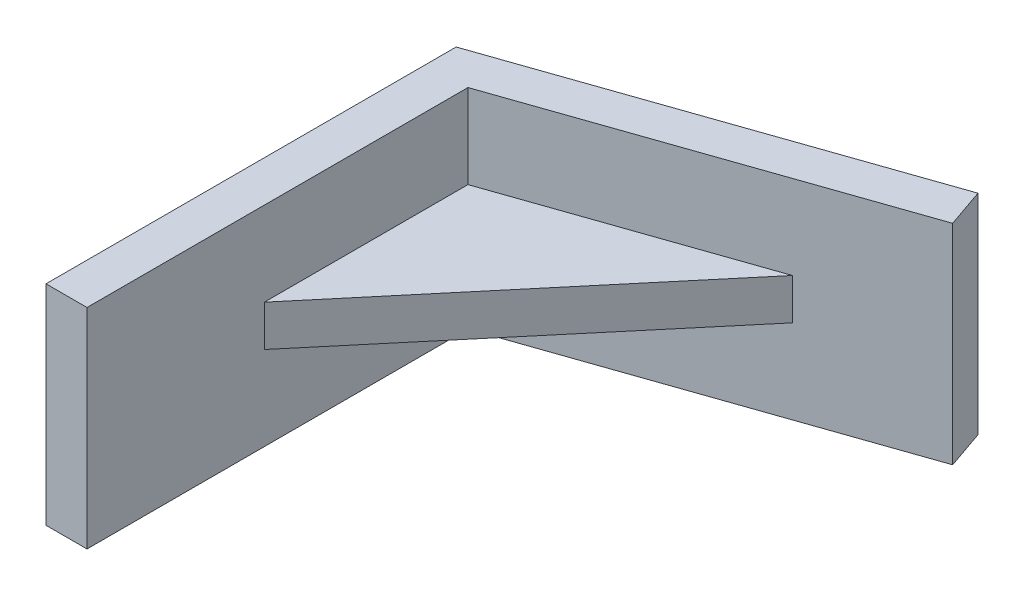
ISO-10303-21;
HEADER;
FILE_DESCRIPTION(('STEP AP214'),'2;1');
FILE_NAME('part.step','',(''),(''),'','','');
FILE_SCHEMA(('AUTOMOTIVE_DESIGN { 1 0 10303 214 1 1 1 1 }'));
ENDSEC;
DATA;
#1=APPLICATION_CONTEXT('core data for automotive mechanical design processes');
#2=APPLICATION_PROTOCOL_DEFINITION('international standard','automotive_design',2000,#1);
#3=PRODUCT_CONTEXT('',#1,'mechanical');
#4=PRODUCT('Part','Part','',(#3));
#5=PRODUCT_RELATED_PRODUCT_CATEGORY('part','',(#4));
#6=PRODUCT_DEFINITION_FORMATION('','',#4);
#7=PRODUCT_DEFINITION_CONTEXT('part definition',#1,'design');
#8=PRODUCT_DEFINITION('design','',#6,#7);
#9=PRODUCT_DEFINITION_SHAPE('','',#8);
#10=(LENGTH_UNIT() NAMED_UNIT(*) SI_UNIT(.MILLI.,.METRE.));
#11=(NAMED_UNIT(*) PLANE_ANGLE_UNIT() SI_UNIT($,.RADIAN.));
#12=(NAMED_UNIT(*) SI_UNIT($,.STERADIAN.) SOLID_ANGLE_UNIT());
#13=UNCERTAINTY_MEASURE_WITH_UNIT(LENGTH_MEASURE(1.E-05),#10,'distance_accuracy_value','');
#14=(GEOMETRIC_REPRESENTATION_CONTEXT(3) GLOBAL_UNCERTAINTY_ASSIGNED_CONTEXT((#13)) GLOBAL_UNIT_ASSIGNED_CONTEXT((#10,
#11,#12)) REPRESENTATION_CONTEXT('',''));
#15=CARTESIAN_POINT('',(0.,0.,0.));
#16=DIRECTION('',(0.,0.,1.));
#17=DIRECTION('',(1.,0.,0.));
#18=AXIS2_PLACEMENT_3D('',#15,#16,#17);
#19=CARTESIAN_POINT('',(-5.00000000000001,25.5,-91.1175916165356));
#20=DIRECTION('',(0.327543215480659,0.,0.944836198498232));
#21=DIRECTION('',(0.944836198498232,0.,-0.327543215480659));
#22=AXIS2_PLACEMENT_3D('',#19,#20,#21);
#23=PLANE('',#22);
#24=DIRECTION('',(-0.944836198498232,0.,0.327543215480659));
#25=VECTOR('',#24,1.);
#26=CARTESIAN_POINT('',(-5.00000000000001,-25.5,-91.1175916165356));
#27=LINE('',#26,#25);
#28=CARTESIAN_POINT('',(89.4836198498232,-25.5,-123.871913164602));
#29=VERTEX_POINT('',#28);
#30=CARTESIAN_POINT('',(-5.00000000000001,-25.5,-91.1175916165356));
#31=VERTEX_POINT('',#30);
#32=EDGE_CURVE('E129',#29,#31,#27,.T.);
#33=ORIENTED_EDGE('',*,*,#32,.T.);
#34=DIRECTION('',(0.,-1.,0.));
#35=VECTOR('',#34,1.);
#36=CARTESIAN_POINT('',(-5.00000000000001,25.5,-91.1175916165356));
#37=LINE('',#36,#35);
#38=CARTESIAN_POINT('',(-5.00000000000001,25.5,-91.1175916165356));
#39=VERTEX_POINT('',#38);
#40=EDGE_CURVE('E118',#39,#31,#37,.T.);
#41=ORIENTED_EDGE('',*,*,#40,.F.);
#42=DIRECTION('',(-0.944836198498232,0.,0.327543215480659));
#43=VECTOR('',#42,1.);
#44=CARTESIAN_POINT('',(-5.00000000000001,25.5,-91.1175916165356));
#45=LINE('',#44,#43);
#46=CARTESIAN_POINT('',(89.4836198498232,25.5,-123.871913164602));
#47=VERTEX_POINT('',#46);
#48=EDGE_CURVE('E130',#47,#39,#45,.T.);
#49=ORIENTED_EDGE('',*,*,#48,.F.);
#50=DIRECTION('',(0.,-1.,0.));
#51=VECTOR('',#50,1.);
#52=CARTESIAN_POINT('',(89.4836198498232,25.5,-123.871913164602));
#53=LINE('',#52,#51);
#54=EDGE_CURVE('E144',#47,#29,#53,.T.);
#55=ORIENTED_EDGE('',*,*,#54,.T.);
#56=EDGE_LOOP('',(#33,#41,#49,#55));
#57=FACE_BOUND('',#56,.T.);
#58=ADVANCED_FACE('F38',(#57),#23,.F.);
#59=CARTESIAN_POINT('',(-5.00000000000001,25.5,-91.1175916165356));
#60=DIRECTION('',(1.,0.,0.));
#61=DIRECTION('',(0.,0.,-1.));
#62=AXIS2_PLACEMENT_3D('',#59,#60,#61);
#63=PLANE('',#62);
#64=ORIENTED_EDGE('',*,*,#40,.T.);
#65=DIRECTION('',(0.,0.,1.));
#66=VECTOR('',#65,1.);
#67=CARTESIAN_POINT('',(-5.00000000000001,-25.5,-91.1175916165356));
#68=LINE('',#67,#66);
#69=CARTESIAN_POINT('',(-5.,-25.5,8.88240838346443));
#70=VERTEX_POINT('',#69);
#71=EDGE_CURVE('E147',#31,#70,#68,.T.);
#72=ORIENTED_EDGE('',*,*,#71,.T.);
#73=DIRECTION('',(0.,-1.,0.));
#74=VECTOR('',#73,1.);
#75=CARTESIAN_POINT('',(-5.,25.5,8.88240838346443));
#76=LINE('',#75,#74);
#77=CARTESIAN_POINT('',(-5.,25.5,8.88240838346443));
#78=VERTEX_POINT('',#77);
#79=EDGE_CURVE('E168',#78,#70,#76,.T.);
#80=ORIENTED_EDGE('',*,*,#79,.F.);
#81=DIRECTION('',(0.,0.,1.));
#82=VECTOR('',#81,1.);
#83=CARTESIAN_POINT('',(-5.00000000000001,25.5,-91.1175916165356));
#84=LINE('',#83,#82);
#85=EDGE_CURVE('E133',#39,#78,#84,.T.);
#86=ORIENTED_EDGE('',*,*,#85,.F.);
#87=EDGE_LOOP('',(#64,#72,#80,#86));
#88=FACE_BOUND('',#87,.T.);
#89=ADVANCED_FACE('F174',(#88),#63,.F.);
#90=CARTESIAN_POINT('',(-5.,25.5,8.88240838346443));
#91=DIRECTION('',(0.,0.,-1.));
#92=DIRECTION('',(-1.,0.,0.));
#93=AXIS2_PLACEMENT_3D('',#90,#91,#92);
#94=PLANE('',#93);
#95=DIRECTION('',(1.,0.,0.));
#96=VECTOR('',#95,1.);
#97=CARTESIAN_POINT('',(-5.,-25.5,8.88240838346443));
#98=LINE('',#97,#96);
#99=CARTESIAN_POINT('',(4.99999999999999,-25.5,8.88240838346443));
#100=VERTEX_POINT('',#99);
#101=EDGE_CURVE('E149',#70,#100,#98,.T.);
#102=ORIENTED_EDGE('',*,*,#101,.T.);
#103=DIRECTION('',(0.,-1.,0.));
#104=VECTOR('',#103,1.);
#105=CARTESIAN_POINT('',(4.99999999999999,25.5,8.88240838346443));
#106=LINE('',#105,#104);
#107=CARTESIAN_POINT('',(4.99999999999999,25.5,8.88240838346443));
#108=VERTEX_POINT('',#107);
#109=EDGE_CURVE('E165',#108,#100,#106,.T.);
#110=ORIENTED_EDGE('',*,*,#109,.F.);
#111=DIRECTION('',(1.,0.,0.));
#112=VECTOR('',#111,1.);
#113=CARTESIAN_POINT('',(-5.,25.5,8.88240838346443));
#114=LINE('',#113,#112);
#115=EDGE_CURVE('E136',#78,#108,#114,.T.);
#116=ORIENTED_EDGE('',*,*,#115,.F.);
#117=ORIENTED_EDGE('',*,*,#79,.T.);
#118=EDGE_LOOP('',(#102,#110,#116,#117));
#119=FACE_BOUND('',#118,.T.);
#120=ADVANCED_FACE('F197',(#119),#94,.F.);
#121=CARTESIAN_POINT('',(5.,25.5,-84.0004131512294));
#122=DIRECTION('',(-1.,0.,0.));
#123=DIRECTION('',(0.,0.,1.));
#124=AXIS2_PLACEMENT_3D('',#121,#122,#123);
#125=PLANE('',#124);
#126=DIRECTION('',(0.,1.,0.));
#127=VECTOR('',#126,1.);
#128=CARTESIAN_POINT('',(4.99999999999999,25.5,-34.3625642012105));
#129=LINE('',#128,#127);
#130=CARTESIAN_POINT('',(4.99999999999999,-5.,-34.3625642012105));
#131=VERTEX_POINT('',#130);
#132=CARTESIAN_POINT('',(4.99999999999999,5.,-34.3625642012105));
#133=VERTEX_POINT('',#132);
#134=EDGE_CURVE('E52',#131,#133,#129,.T.);
#135=ORIENTED_EDGE('',*,*,#134,.T.);
#136=DIRECTION('',(0.,0.,-1.));
#137=VECTOR('',#136,1.);
#138=CARTESIAN_POINT('',(5.,5.,-84.0004131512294));
#139=LINE('',#138,#137);
#140=CARTESIAN_POINT('',(5.,5.,-84.0004131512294));
#141=VERTEX_POINT('',#140);
#142=EDGE_CURVE('E126',#133,#141,#139,.T.);
#143=ORIENTED_EDGE('',*,*,#142,.T.);
#144=DIRECTION('',(0.,-1.,0.));
#145=VECTOR('',#144,1.);
#146=CARTESIAN_POINT('',(5.,25.5,-84.0004131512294));
#147=LINE('',#146,#145);
#148=CARTESIAN_POINT('',(5.,25.5,-84.0004131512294));
#149=VERTEX_POINT('',#148);
#150=EDGE_CURVE('E163',#149,#141,#147,.T.);
#151=ORIENTED_EDGE('',*,*,#150,.F.);
#152=DIRECTION('',(0.,0.,-1.));
#153=VECTOR('',#152,1.);
#154=CARTESIAN_POINT('',(5.,25.5,-84.0004131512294));
#155=LINE('',#154,#153);
#156=EDGE_CURVE('E138',#108,#149,#155,.T.);
#157=ORIENTED_EDGE('',*,*,#156,.F.);
#158=ORIENTED_EDGE('',*,*,#109,.T.);
#159=DIRECTION('',(0.,0.,-1.));
#160=VECTOR('',#159,1.);
#161=CARTESIAN_POINT('',(5.,-25.5,-84.0004131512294));
#162=LINE('',#161,#160);
#163=CARTESIAN_POINT('',(5.,-25.5,-84.0004131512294));
#164=VERTEX_POINT('',#163);
#165=EDGE_CURVE('E151',#100,#164,#162,.T.);
#166=ORIENTED_EDGE('',*,*,#165,.T.);
#167=CARTESIAN_POINT('',(5.,-5.,-84.0004131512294));
#168=VERTEX_POINT('',#167);
#169=EDGE_CURVE('E162',#168,#164,#147,.T.);
#170=ORIENTED_EDGE('',*,*,#169,.F.);
#171=DIRECTION('',(0.,0.,-1.));
#172=VECTOR('',#171,1.);
#173=CARTESIAN_POINT('',(5.,-5.,-84.0004131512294));
#174=LINE('',#173,#172);
#175=EDGE_CURVE('E57',#131,#168,#174,.T.);
#176=ORIENTED_EDGE('',*,*,#175,.F.);
#177=EDGE_LOOP('',(#135,#143,#151,#157,#158,#166,#170,#176));
#178=FACE_BOUND('',#177,.T.);
#179=ADVANCED_FACE('F191',(#178),#125,.F.);
#180=CARTESIAN_POINT('',(5.,25.5,-84.0004131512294));
#181=DIRECTION('',(-0.327543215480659,0.,-0.944836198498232));
#182=DIRECTION('',(-0.944836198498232,0.,0.327543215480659));
#183=AXIS2_PLACEMENT_3D('',#180,#181,#182);
#184=PLANE('',#183);
#185=ORIENTED_EDGE('',*,*,#150,.T.);
#186=DIRECTION('',(0.944836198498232,0.,-0.327543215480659));
#187=VECTOR('',#186,1.);
#188=CARTESIAN_POINT('',(5.,5.,-84.0004131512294));
#189=LINE('',#188,#187);
#190=CARTESIAN_POINT('',(63.7369741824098,5.,-104.36256420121));
#191=VERTEX_POINT('',#190);
#192=EDGE_CURVE('E11',#141,#191,#189,.T.);
#193=ORIENTED_EDGE('',*,*,#192,.T.);
#194=DIRECTION('',(0.,-1.,0.));
#195=VECTOR('',#194,1.);
#196=CARTESIAN_POINT('',(63.7369741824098,25.5,-104.36256420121));
#197=LINE('',#196,#195);
#198=CARTESIAN_POINT('',(63.7369741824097,-5.,-104.36256420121));
#199=VERTEX_POINT('',#198);
#200=EDGE_CURVE('E45',#191,#199,#197,.T.);
#201=ORIENTED_EDGE('',*,*,#200,.T.);
#202=DIRECTION('',(0.944836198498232,0.,-0.327543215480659));
#203=VECTOR('',#202,1.);
#204=CARTESIAN_POINT('',(5.,-5.,-84.0004131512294));
#205=LINE('',#204,#203);
#206=EDGE_CURVE('E108',#168,#199,#205,.T.);
#207=ORIENTED_EDGE('',*,*,#206,.F.);
#208=ORIENTED_EDGE('',*,*,#169,.T.);
#209=DIRECTION('',(0.944836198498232,0.,-0.327543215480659));
#210=VECTOR('',#209,1.);
#211=CARTESIAN_POINT('',(5.,-25.5,-84.0004131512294));
#212=LINE('',#211,#210);
#213=CARTESIAN_POINT('',(92.7590520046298,-25.5,-114.423551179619));
#214=VERTEX_POINT('',#213);
#215=EDGE_CURVE('E154',#164,#214,#212,.T.);
#216=ORIENTED_EDGE('',*,*,#215,.T.);
#217=DIRECTION('',(0.,-1.,0.));
#218=VECTOR('',#217,1.);
#219=CARTESIAN_POINT('',(92.7590520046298,25.5,-114.423551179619));
#220=LINE('',#219,#218);
#221=CARTESIAN_POINT('',(92.7590520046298,25.5,-114.423551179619));
#222=VERTEX_POINT('',#221);
#223=EDGE_CURVE('E159',#222,#214,#220,.T.);
#224=ORIENTED_EDGE('',*,*,#223,.F.);
#225=DIRECTION('',(0.944836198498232,0.,-0.327543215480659));
#226=VECTOR('',#225,1.);
#227=CARTESIAN_POINT('',(5.,25.5,-84.0004131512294));
#228=LINE('',#227,#226);
#229=EDGE_CURVE('E140',#149,#222,#228,.T.);
#230=ORIENTED_EDGE('',*,*,#229,.F.);
#231=EDGE_LOOP('',(#185,#193,#201,#207,#208,#216,#224,#230));
#232=FACE_BOUND('',#231,.T.);
#233=ADVANCED_FACE('F107',(#232),#184,.F.);
#234=CARTESIAN_POINT('',(89.4836198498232,25.5,-123.871913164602));
#235=DIRECTION('',(-0.944836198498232,0.,0.32754321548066));
#236=DIRECTION('',(0.32754321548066,0.,0.944836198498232));
#237=AXIS2_PLACEMENT_3D('',#234,#235,#236);
#238=PLANE('',#237);
#239=DIRECTION('',(-0.32754321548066,0.,-0.944836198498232));
#240=VECTOR('',#239,1.);
#241=CARTESIAN_POINT('',(89.4836198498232,-25.5,-123.871913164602));
#242=LINE('',#241,#240);
#243=EDGE_CURVE('E134',#214,#29,#242,.T.);
#244=ORIENTED_EDGE('',*,*,#243,.T.);
#245=ORIENTED_EDGE('',*,*,#54,.F.);
#246=DIRECTION('',(-0.32754321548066,0.,-0.944836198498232));
#247=VECTOR('',#246,1.);
#248=CARTESIAN_POINT('',(89.4836198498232,25.5,-123.871913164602));
#249=LINE('',#248,#247);
#250=EDGE_CURVE('E142',#222,#47,#249,.T.);
#251=ORIENTED_EDGE('',*,*,#250,.F.);
#252=ORIENTED_EDGE('',*,*,#223,.T.);
#253=EDGE_LOOP('',(#244,#245,#251,#252));
#254=FACE_BOUND('',#253,.T.);
#255=ADVANCED_FACE('F187',(#254),#238,.F.);
#256=CARTESIAN_POINT('',(0.,25.5,0.));
#257=DIRECTION('',(0.,-1.,0.));
#258=DIRECTION('',(0.,0.,-1.));
#259=AXIS2_PLACEMENT_3D('',#256,#257,#258);
#260=PLANE('',#259);
#261=ORIENTED_EDGE('',*,*,#48,.T.);
#262=ORIENTED_EDGE('',*,*,#85,.T.);
#263=ORIENTED_EDGE('',*,*,#115,.T.);
#264=ORIENTED_EDGE('',*,*,#156,.T.);
#265=ORIENTED_EDGE('',*,*,#229,.T.);
#266=ORIENTED_EDGE('',*,*,#250,.T.);
#267=EDGE_LOOP('',(#261,#262,#263,#264,#265,#266));
#268=FACE_BOUND('',#267,.T.);
#269=ADVANCED_FACE('F199',(#268),#260,.F.);
#270=CARTESIAN_POINT('',(0.,-25.5,0.));
#271=DIRECTION('',(0.,-1.,0.));
#272=DIRECTION('',(0.,0.,-1.));
#273=AXIS2_PLACEMENT_3D('',#270,#271,#272);
#274=PLANE('',#273);
#275=ORIENTED_EDGE('',*,*,#32,.F.);
#276=ORIENTED_EDGE('',*,*,#243,.F.);
#277=ORIENTED_EDGE('',*,*,#215,.F.);
#278=ORIENTED_EDGE('',*,*,#165,.F.);
#279=ORIENTED_EDGE('',*,*,#101,.F.);
#280=ORIENTED_EDGE('',*,*,#71,.F.);
#281=EDGE_LOOP('',(#275,#276,#277,#278,#279,#280));
#282=FACE_BOUND('',#281,.T.);
#283=ADVANCED_FACE('F181',(#282),#274,.T.);
#284=CARTESIAN_POINT('',(4.99999999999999,0.,-34.3625642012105));
#285=DIRECTION('',(0.766044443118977,0.,0.64278760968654));
#286=DIRECTION('',(0.64278760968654,0.,-0.766044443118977));
#287=AXIS2_PLACEMENT_3D('',#284,#285,#286);
#288=PLANE('',#287);
#289=ORIENTED_EDGE('',*,*,#134,.F.);
#290=DIRECTION('',(0.64278760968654,0.,-0.766044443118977));
#291=VECTOR('',#290,1.);
#292=CARTESIAN_POINT('',(4.99999999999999,-5.,-34.3625642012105));
#293=LINE('',#292,#291);
#294=EDGE_CURVE('E117',#131,#199,#293,.T.);
#295=ORIENTED_EDGE('',*,*,#294,.T.);
#296=ORIENTED_EDGE('',*,*,#200,.F.);
#297=DIRECTION('',(0.64278760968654,0.,-0.766044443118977));
#298=VECTOR('',#297,1.);
#299=CARTESIAN_POINT('',(4.99999999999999,5.,-34.3625642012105));
#300=LINE('',#299,#298);
#301=EDGE_CURVE('E121',#133,#191,#300,.T.);
#302=ORIENTED_EDGE('',*,*,#301,.F.);
#303=EDGE_LOOP('',(#289,#295,#296,#302));
#304=FACE_BOUND('',#303,.T.);
#305=ADVANCED_FACE('F120',(#304),#288,.T.);
#306=CARTESIAN_POINT('',(43.8795260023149,5.,-57.4947523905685));
#307=DIRECTION('',(0.,1.,0.));
#308=DIRECTION('',(0.,0.,1.));
#309=AXIS2_PLACEMENT_3D('',#306,#307,#308);
#310=PLANE('',#309);
#311=ORIENTED_EDGE('',*,*,#142,.F.);
#312=ORIENTED_EDGE('',*,*,#301,.T.);
#313=ORIENTED_EDGE('',*,*,#192,.F.);
#314=EDGE_LOOP('',(#311,#312,#313));
#315=FACE_BOUND('',#314,.T.);
#316=ADVANCED_FACE('F201',(#315),#310,.T.);
#317=CARTESIAN_POINT('',(43.8795260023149,-5.,-57.4947523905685));
#318=DIRECTION('',(0.,1.,0.));
#319=DIRECTION('',(0.,0.,1.));
#320=AXIS2_PLACEMENT_3D('',#317,#318,#319);
#321=PLANE('',#320);
#322=ORIENTED_EDGE('',*,*,#294,.F.);
#323=ORIENTED_EDGE('',*,*,#175,.T.);
#324=ORIENTED_EDGE('',*,*,#206,.T.);
#325=EDGE_LOOP('',(#322,#323,#324));
#326=FACE_BOUND('',#325,.T.);
#327=ADVANCED_FACE('F116',(#326),#321,.F.);
#328=CLOSED_SHELL('',(#58,#89,#120,#179,#233,#255,#269,#283,#305,#316,#327));
#329=MANIFOLD_SOLID_BREP('B2',#328);
#330=ADVANCED_BREP_SHAPE_REPRESENTATION('',(#18,#329),#14);
#331=SHAPE_DEFINITION_REPRESENTATION(#9,#330);
ENDSEC;
END-ISO-10303-21;
